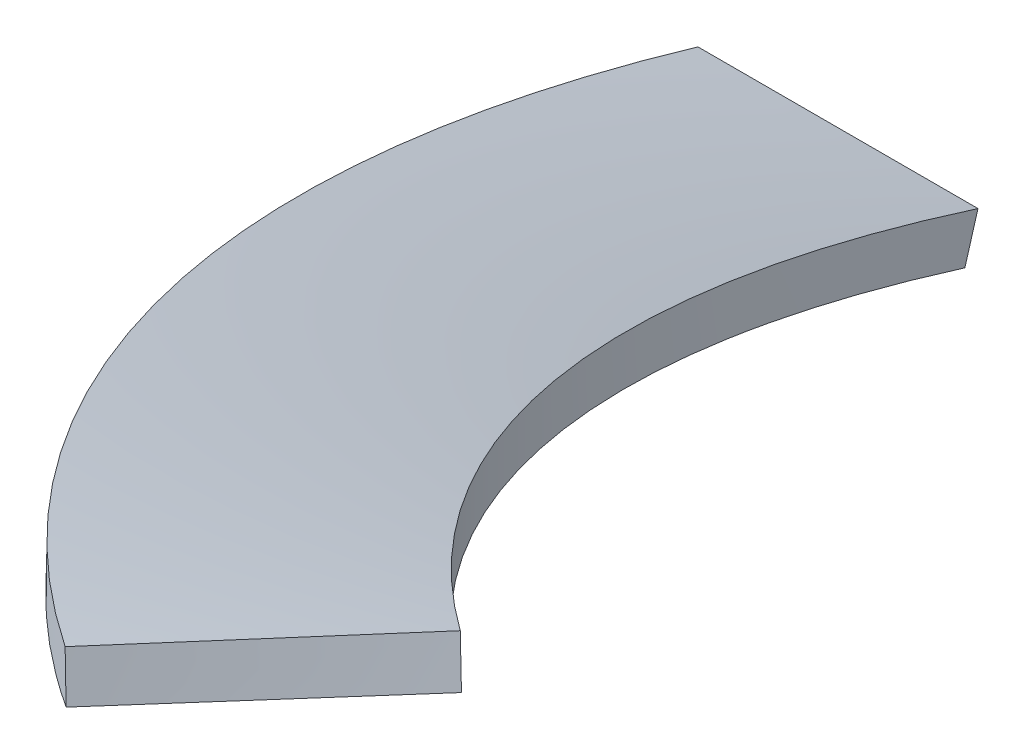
ISO-10303-21;
HEADER;
FILE_DESCRIPTION(('STEP AP214'),'2;1');
FILE_NAME('part.step','',(''),(''),'','','');
FILE_SCHEMA(('AUTOMOTIVE_DESIGN { 1 0 10303 214 1 1 1 1 }'));
ENDSEC;
DATA;
#1=APPLICATION_CONTEXT('core data for automotive mechanical design processes');
#2=APPLICATION_PROTOCOL_DEFINITION('international standard','automotive_design',2000,#1);
#3=PRODUCT_CONTEXT('',#1,'mechanical');
#4=PRODUCT('Part','Part','',(#3));
#5=PRODUCT_RELATED_PRODUCT_CATEGORY('part','',(#4));
#6=PRODUCT_DEFINITION_FORMATION('','',#4);
#7=PRODUCT_DEFINITION_CONTEXT('part definition',#1,'design');
#8=PRODUCT_DEFINITION('design','',#6,#7);
#9=PRODUCT_DEFINITION_SHAPE('','',#8);
#10=(LENGTH_UNIT() NAMED_UNIT(*) SI_UNIT(.MILLI.,.METRE.));
#11=(NAMED_UNIT(*) PLANE_ANGLE_UNIT() SI_UNIT($,.RADIAN.));
#12=(NAMED_UNIT(*) SI_UNIT($,.STERADIAN.) SOLID_ANGLE_UNIT());
#13=UNCERTAINTY_MEASURE_WITH_UNIT(LENGTH_MEASURE(1.E-05),#10,'distance_accuracy_value','');
#14=(GEOMETRIC_REPRESENTATION_CONTEXT(3) GLOBAL_UNCERTAINTY_ASSIGNED_CONTEXT((#13)) GLOBAL_UNIT_ASSIGNED_CONTEXT((#10,
#11,#12)) REPRESENTATION_CONTEXT('',''));
#15=CARTESIAN_POINT('',(0.,0.,0.));
#16=DIRECTION('',(0.,0.,1.));
#17=DIRECTION('',(1.,0.,0.));
#18=AXIS2_PLACEMENT_3D('',#15,#16,#17);
#19=CARTESIAN_POINT('',(-175.193409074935,60.3369175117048,205.460201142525));
#20=CARTESIAN_POINT('',(-237.087912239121,39.3166045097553,156.373113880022));
#21=CARTESIAN_POINT('',(-272.113883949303,13.6346725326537,81.9466816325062));
#22=CARTESIAN_POINT('',(-270.,-9.59508945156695,2.81678157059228));
#23=CARTESIAN_POINT('',(-177.135937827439,70.,203.771586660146));
#24=CARTESIAN_POINT('',(-238.775544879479,48.8557085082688,153.681809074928));
#25=CARTESIAN_POINT('',(-272.894339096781,23.137303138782,78.8149480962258));
#26=CARTESIAN_POINT('',(-270.,0.,0.));
#27=B_SPLINE_SURFACE_WITH_KNOTS('',1,3,((#19,#20,#21,#22),(#23,#24,#25,#26)),.UNSPECIFIED.,.F.,
.F.,.F.,(2,2),(4,4),(0.,1.),(0.,1.),.UNSPECIFIED.);
#28=CARTESIAN_POINT('',(-270.,0.,0.));
#29=CARTESIAN_POINT('',(-270.,-9.59508945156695,2.81678157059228));
#30=B_SPLINE_CURVE_WITH_KNOTS('',1,(#28,#29),.UNSPECIFIED.,.F.,.F.,(2,2),(0.,1.),.UNSPECIFIED.);
#31=CARTESIAN_POINT('',(-270.,0.,0.));
#32=VERTEX_POINT('',#31);
#33=CARTESIAN_POINT('',(-270.00000003,-9.59508945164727,2.81678157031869));
#34=VERTEX_POINT('',#33);
#35=EDGE_CURVE('E14',#32,#34,#30,.T.);
#36=CARTESIAN_POINT('',(-270.,0.,0.));
#37=CARTESIAN_POINT('',(-272.894339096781,23.137303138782,78.8149480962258));
#38=CARTESIAN_POINT('',(-238.775544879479,48.8557085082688,153.681809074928));
#39=CARTESIAN_POINT('',(-177.135937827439,70.,203.771586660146));
#40=B_SPLINE_CURVE_WITH_KNOTS('',3,(#36,#37,#38,#39),.UNSPECIFIED.,.F.,.F.,(4,4),(0.,1.),.UNSPECIFIED.);
#41=CARTESIAN_POINT('',(-177.135937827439,70.,203.771586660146));
#42=VERTEX_POINT('',#41);
#43=EDGE_CURVE('E240',#32,#42,#40,.T.);
#44=CARTESIAN_POINT('',(-177.135937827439,70.,203.771586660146));
#45=CARTESIAN_POINT('',(-175.193409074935,60.3369175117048,205.460201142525));
#46=B_SPLINE_CURVE_WITH_KNOTS('',1,(#44,#45),.UNSPECIFIED.,.F.,.F.,(2,2),(0.,1.),.UNSPECIFIED.);
#47=CARTESIAN_POINT('',(-175.193409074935,60.3369175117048,205.460201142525));
#48=VERTEX_POINT('',#47);
#49=EDGE_CURVE('E73',#42,#48,#46,.T.);
#50=CARTESIAN_POINT('',(-270.,-9.59508945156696,2.81678157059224));
#51=CARTESIAN_POINT('',(-270.131868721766,-8.1483533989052,7.74501807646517));
#52=CARTESIAN_POINT('',(-270.119708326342,-6.68677843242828,12.6727601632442));
#53=CARTESIAN_POINT('',(-269.808527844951,-3.74764646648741,22.4814964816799));
#54=CARTESIAN_POINT('',(-269.511264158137,-2.27024206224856,27.3625922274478));
#55=CARTESIAN_POINT('',(-268.634944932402,0.696987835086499,37.0678336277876));
#56=CARTESIAN_POINT('',(-268.057354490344,2.18670959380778,41.8921432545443));
#57=CARTESIAN_POINT('',(-266.625741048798,5.17500170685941,51.4736454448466));
#58=CARTESIAN_POINT('',(-265.772914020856,6.67350672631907,56.2310371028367));
#59=CARTESIAN_POINT('',(-263.796074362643,9.67582153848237,65.6685740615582));
#60=CARTESIAN_POINT('',(-262.673011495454,11.1795949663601,70.3489298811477));
#61=CARTESIAN_POINT('',(-260.160945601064,14.1889177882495,79.6222954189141));
#62=CARTESIAN_POINT('',(-258.772666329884,15.6944515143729,84.2155062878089));
#63=CARTESIAN_POINT('',(-255.735386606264,18.7037823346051,93.3045081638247));
#64=CARTESIAN_POINT('',(-254.086901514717,20.2075770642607,97.800472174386));
#65=CARTESIAN_POINT('',(-250.534414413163,23.2099314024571,106.68492955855));
#66=CARTESIAN_POINT('',(-248.630734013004,24.7084952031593,111.073550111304));
#67=CARTESIAN_POINT('',(-244.573048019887,27.6969028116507,119.733291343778));
#68=CARTESIAN_POINT('',(-242.419181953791,29.1867509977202,124.004475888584));
#69=CARTESIAN_POINT('',(-237.866308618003,32.1542560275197,132.419337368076));
#70=CARTESIAN_POINT('',(-235.467267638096,33.6319111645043,136.562996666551));
#71=CARTESIAN_POINT('',(-230.429224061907,36.571572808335,144.712822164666));
#72=CARTESIAN_POINT('',(-227.79002088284,38.0335650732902,148.718869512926));
#73=CARTESIAN_POINT('',(-222.276832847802,40.9384593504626,156.583511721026));
#74=CARTESIAN_POINT('',(-219.402484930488,42.3813276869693,160.441864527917));
#75=CARTESIAN_POINT('',(-213.424185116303,45.2445489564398,168.00118236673));
#76=CARTESIAN_POINT('',(-210.319710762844,46.6648411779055,171.701757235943));
#77=CARTESIAN_POINT('',(-203.886354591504,49.4795085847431,178.935633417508));
#78=CARTESIAN_POINT('',(-200.556793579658,50.8737875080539,182.468368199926));
#79=CARTESIAN_POINT('',(-193.67840704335,53.6330370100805,189.35665583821));
#80=CARTESIAN_POINT('',(-190.128748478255,54.9978660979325,192.711433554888));
#81=CARTESIAN_POINT('',(-182.815528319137,57.6949006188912,199.23417451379));
#82=CARTESIAN_POINT('',(-179.050985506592,59.0269086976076,202.401119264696));
#83=CARTESIAN_POINT('',(-175.193409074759,60.3369175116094,205.460201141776));
#84=B_SPLINE_CURVE_WITH_KNOTS('',3,(#50,#51,#52,#53,#54,#55,#56,#57,#58,#59,#60,#61,#62,#63,#64,
#65,#66,#67,#68,#69,#70,#71,#72,#73,#74,#75,#76,#77,#78,#79,#80,#81,#82,#83),.UNSPECIFIED.,.F.,
.F.,(4,2,2,2,2,2,2,2,2,2,2,2,2,2,2,2,4),(0.,15.4116577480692,30.7289766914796,45.9670896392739,
61.1398610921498,76.260066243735,91.339584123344,106.389602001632,121.42082834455,
136.443711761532,151.468663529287,166.506281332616,181.567571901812,196.66417014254,
211.808552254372,227.014240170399,242.295994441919),.UNSPECIFIED.);
#85=EDGE_CURVE('E126',#34,#48,#84,.T.);
#86=ORIENTED_EDGE('',*,*,#35,.F.);
#87=ORIENTED_EDGE('',*,*,#43,.T.);
#88=ORIENTED_EDGE('',*,*,#49,.T.);
#89=ORIENTED_EDGE('',*,*,#85,.F.);
#90=EDGE_LOOP('',(#86,#87,#88,#89));
#91=FACE_BOUND('',#90,.T.);
#92=ADVANCED_FACE('F59',(#91),#27,.F.);
#93=CARTESIAN_POINT('',(-175.193409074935,60.3369175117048,205.460201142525));
#94=CARTESIAN_POINT('',(-188.478628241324,60.2790215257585,220.411788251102));
#95=CARTESIAN_POINT('',(-201.73144094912,60.2397884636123,235.391563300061));
#96=CARTESIAN_POINT('',(-214.965490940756,60.2087426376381,250.387637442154));
#97=CARTESIAN_POINT('',(-177.135937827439,70.,203.771586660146));
#98=CARTESIAN_POINT('',(-190.25711840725,70.,218.865778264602));
#99=CARTESIAN_POINT('',(-203.37829898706,70.,233.959969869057));
#100=CARTESIAN_POINT('',(-216.49947956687,70.,249.054161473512));
#101=B_SPLINE_SURFACE_WITH_KNOTS('',1,3,((#93,#94,#95,#96),(#97,#98,#99,#100)),.UNSPECIFIED.,
.F.,.F.,.F.,(2,2),(4,4),(0.,1.),(-0.03,0.03),.UNSPECIFIED.);
#102=CARTESIAN_POINT('',(-177.135937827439,70.,203.771586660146));
#103=CARTESIAN_POINT('',(-190.25711840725,70.,218.865778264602));
#104=CARTESIAN_POINT('',(-203.37829898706,70.,233.959969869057));
#105=CARTESIAN_POINT('',(-216.49947956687,70.,249.054161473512));
#106=B_SPLINE_CURVE_WITH_KNOTS('',3,(#102,#103,#104,#105),.UNSPECIFIED.,.F.,.F.,(4,4),(-0.03,
0.03),.UNSPECIFIED.);
#107=CARTESIAN_POINT('',(-216.49947956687,70.,249.054161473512));
#108=VERTEX_POINT('',#107);
#109=EDGE_CURVE('E109',#42,#108,#106,.T.);
#110=CARTESIAN_POINT('',(-216.49947956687,70.,249.054161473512));
#111=CARTESIAN_POINT('',(-214.965490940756,60.2087426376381,250.387637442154));
#112=B_SPLINE_CURVE_WITH_KNOTS('',1,(#110,#111),.UNSPECIFIED.,.F.,.F.,(2,2),(0.,1.),.UNSPECIFIED.);
#113=CARTESIAN_POINT('',(-214.965490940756,60.2087426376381,250.387637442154));
#114=VERTEX_POINT('',#113);
#115=EDGE_CURVE('E103',#108,#114,#112,.T.);
#116=CARTESIAN_POINT('',(-175.193409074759,60.3369175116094,205.460201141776));
#117=CARTESIAN_POINT('',(-176.854055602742,60.3296818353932,207.329145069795));
#118=CARTESIAN_POINT('',(-178.514190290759,60.3227495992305,209.198544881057));
#119=CARTESIAN_POINT('',(-181.833491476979,60.309436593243,212.938186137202));
#120=CARTESIAN_POINT('',(-183.492657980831,60.3030558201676,214.808427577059));
#121=CARTESIAN_POINT('',(-186.810089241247,60.2907902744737,218.549694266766));
#122=CARTESIAN_POINT('',(-188.468354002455,60.2849054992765,220.42071951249));
#123=CARTESIAN_POINT('',(-191.784041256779,60.2735846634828,224.163502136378));
#124=CARTESIAN_POINT('',(-193.441463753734,60.2681486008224,226.035259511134));
#125=CARTESIAN_POINT('',(-196.755521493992,60.2576827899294,229.779458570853));
#126=CARTESIAN_POINT('',(-198.412156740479,60.2526530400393,231.651900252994));
#127=CARTESIAN_POINT('',(-201.724690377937,60.2429623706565,235.39742412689));
#128=CARTESIAN_POINT('',(-203.380588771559,60.238301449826,237.270506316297));
#129=CARTESIAN_POINT('',(-206.691695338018,60.2293148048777,241.017270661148));
#130=CARTESIAN_POINT('',(-208.346903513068,60.2249890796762,242.890952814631));
#131=CARTESIAN_POINT('',(-211.656671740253,60.2166436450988,246.638880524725));
#132=CARTESIAN_POINT('',(-213.311231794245,60.2126239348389,248.513126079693));
#133=CARTESIAN_POINT('',(-214.96549093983,60.2087426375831,250.387637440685));
#134=B_SPLINE_CURVE_WITH_KNOTS('',3,(#116,#117,#118,#119,#120,#121,#122,#123,#124,#125,#126,
#127,#128,#129,#130,#131,#132,#133),.UNSPECIFIED.,.F.,.F.,(4,2,2,2,2,2,2,2,4),(0.,
7.50045017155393,15.0008561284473,22.5012230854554,30.0015555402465,37.5018573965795,
45.0021320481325,52.5023824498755,60.0026111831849),.UNSPECIFIED.);
#135=EDGE_CURVE('E107',#48,#114,#134,.T.);
#136=ORIENTED_EDGE('',*,*,#49,.F.);
#137=ORIENTED_EDGE('',*,*,#109,.T.);
#138=ORIENTED_EDGE('',*,*,#115,.T.);
#139=ORIENTED_EDGE('',*,*,#135,.F.);
#140=EDGE_LOOP('',(#136,#137,#138,#139));
#141=FACE_BOUND('',#140,.T.);
#142=ADVANCED_FACE('F106',(#141),#101,.T.);
#143=CARTESIAN_POINT('',(-214.965490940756,60.2087426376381,250.387637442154));
#144=CARTESIAN_POINT('',(-293.117488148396,40.0469066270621,192.249768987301));
#145=CARTESIAN_POINT('',(-336.339228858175,13.8986842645,99.4837045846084));
#146=CARTESIAN_POINT('',(-330.,-9.71687059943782,2.36271575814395));
#147=CARTESIAN_POINT('',(-216.49947956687,70.,249.054161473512));
#148=CARTESIAN_POINT('',(-294.518646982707,49.7372758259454,190.022702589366));
#149=CARTESIAN_POINT('',(-336.982063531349,23.5485046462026,96.8452390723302));
#150=CARTESIAN_POINT('',(-330.,0.,0.));
#151=B_SPLINE_SURFACE_WITH_KNOTS('',1,3,((#143,#144,#145,#146),(#147,#148,#149,#150)),
.UNSPECIFIED.,.F.,.F.,.F.,(2,2),(4,4),(0.,1.),(0.,1.),.UNSPECIFIED.);
#152=CARTESIAN_POINT('',(-216.49947956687,70.,249.054161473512));
#153=CARTESIAN_POINT('',(-294.518646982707,49.7372758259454,190.022702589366));
#154=CARTESIAN_POINT('',(-336.982063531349,23.5485046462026,96.8452390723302));
#155=CARTESIAN_POINT('',(-330.,0.,0.));
#156=B_SPLINE_CURVE_WITH_KNOTS('',3,(#152,#153,#154,#155),.UNSPECIFIED.,.F.,.F.,(4,4),(0.,1.),.UNSPECIFIED.);
#157=CARTESIAN_POINT('',(-330.,0.,0.));
#158=VERTEX_POINT('',#157);
#159=EDGE_CURVE('E128',#108,#158,#156,.T.);
#160=CARTESIAN_POINT('',(-330.,0.,0.));
#161=CARTESIAN_POINT('',(-330.,-9.71687059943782,2.36271575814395));
#162=B_SPLINE_CURVE_WITH_KNOTS('',1,(#160,#161),.UNSPECIFIED.,.F.,.F.,(2,2),(0.,1.),.UNSPECIFIED.);
#163=CARTESIAN_POINT('',(-329.99999997,-9.71687059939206,2.36271575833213));
#164=VERTEX_POINT('',#163);
#165=EDGE_CURVE('E116',#158,#164,#162,.T.);
#166=CARTESIAN_POINT('',(-214.96549093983,60.2087426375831,250.387637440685));
#167=CARTESIAN_POINT('',(-217.403238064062,59.5798541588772,248.574207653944));
#168=CARTESIAN_POINT('',(-219.811568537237,58.9439743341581,246.723655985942));
#169=CARTESIAN_POINT('',(-224.558935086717,57.6610302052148,242.956536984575));
#170=CARTESIAN_POINT('',(-226.898180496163,57.0140117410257,241.040217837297));
#171=CARTESIAN_POINT('',(-231.506474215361,55.7093032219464,237.143411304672));
#172=CARTESIAN_POINT('',(-233.775718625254,55.0516527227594,235.163142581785));
#173=CARTESIAN_POINT('',(-238.243129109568,53.7261991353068,231.140311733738));
#174=CARTESIAN_POINT('',(-240.441477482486,53.0584298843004,229.097940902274));
#175=CARTESIAN_POINT('',(-244.766210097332,51.7132568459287,224.952772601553));
#176=CARTESIAN_POINT('',(-246.892762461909,51.0358817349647,222.850141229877));
#177=CARTESIAN_POINT('',(-251.073019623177,49.6720158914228,218.586319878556));
#178=CARTESIAN_POINT('',(-253.12687806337,48.9855491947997,216.425272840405));
#179=CARTESIAN_POINT('',(-257.160864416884,47.6040194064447,212.046486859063));
#180=CARTESIAN_POINT('',(-259.141131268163,46.9089762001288,209.82886963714));
#181=CARTESIAN_POINT('',(-263.027052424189,45.510813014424,205.338809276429));
#182=CARTESIAN_POINT('',(-264.932830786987,44.8077092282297,203.066468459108));
#183=CARTESIAN_POINT('',(-268.668893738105,43.3939448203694,198.468825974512));
#184=CARTESIAN_POINT('',(-270.499287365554,42.68329712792,196.143608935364));
#185=CARTESIAN_POINT('',(-274.083700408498,41.2549651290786,191.442078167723));
#186=CARTESIAN_POINT('',(-275.837813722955,40.5372908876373,189.065832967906));
#187=CARTESIAN_POINT('',(-279.26878647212,39.0954262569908,184.264109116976));
#188=CARTESIAN_POINT('',(-280.945724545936,38.3712434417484,181.83868438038));
#189=CARTESIAN_POINT('',(-284.221467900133,36.9168823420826,176.940463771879));
#190=CARTESIAN_POINT('',(-285.820336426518,36.1867094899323,174.467708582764));
#191=CARTESIAN_POINT('',(-288.939062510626,34.7208891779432,169.476688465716));
#192=CARTESIAN_POINT('',(-290.458967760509,33.9852453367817,166.958452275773));
#193=CARTESIAN_POINT('',(-293.418889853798,32.5090040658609,161.878330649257));
#194=CARTESIAN_POINT('',(-294.858938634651,31.7684087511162,159.316463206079));
#195=CARTESIAN_POINT('',(-297.658271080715,30.2827856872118,154.150938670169));
#196=CARTESIAN_POINT('',(-299.01757067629,29.5377588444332,151.547289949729));
#197=CARTESIAN_POINT('',(-301.654528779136,28.0437939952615,146.300061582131));
#198=CARTESIAN_POINT('',(-302.932186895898,27.294855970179,143.656481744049));
#199=CARTESIAN_POINT('',(-305.404986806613,25.7935901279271,138.33124900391));
#200=CARTESIAN_POINT('',(-306.600111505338,25.0412616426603,135.649588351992));
#201=CARTESIAN_POINT('',(-308.906970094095,23.5337363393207,130.250051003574));
#202=CARTESIAN_POINT('',(-310.018669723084,22.7785384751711,127.532159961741));
#203=CARTESIAN_POINT('',(-312.157804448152,21.2657959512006,122.062018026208));
#204=CARTESIAN_POINT('',(-313.185187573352,20.5082501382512,119.309747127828));
#205=CARTESIAN_POINT('',(-315.154816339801,18.9913333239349,113.772700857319));
#206=CARTESIAN_POINT('',(-316.096991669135,18.2319613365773,110.987900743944));
#207=CARTESIAN_POINT('',(-317.895332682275,16.7119138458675,105.38765062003));
#208=CARTESIAN_POINT('',(-318.751408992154,15.9512378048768,102.572172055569));
#209=CARTESIAN_POINT('',(-320.376680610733,14.4291039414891,96.9124188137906));
#210=CARTESIAN_POINT('',(-321.145766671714,13.667646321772,94.0681127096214));
#211=CARTESIAN_POINT('',(-322.596187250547,12.1444710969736,88.3525573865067));
#212=CARTESIAN_POINT('',(-323.277391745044,11.3827547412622,85.4812748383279));
#213=CARTESIAN_POINT('',(-324.551179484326,9.85958390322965,79.713618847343));
#214=CARTESIAN_POINT('',(-325.143610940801,9.0981320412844,76.8172111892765));
#215=CARTESIAN_POINT('',(-326.238983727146,7.5760121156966,71.0011564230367));
#216=CARTESIAN_POINT('',(-326.741750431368,6.8153483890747,68.0814752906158));
#217=CARTESIAN_POINT('',(-327.656925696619,5.29532672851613,62.2207242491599));
#218=CARTESIAN_POINT('',(-328.069135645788,4.53597521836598,59.2796216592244));
#219=CARTESIAN_POINT('',(-328.802330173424,3.01910006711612,53.3778776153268));
#220=CARTESIAN_POINT('',(-329.123090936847,2.26158533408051,50.4172060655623));
#221=CARTESIAN_POINT('',(-329.672520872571,0.748905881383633,44.478173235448));
#222=CARTESIAN_POINT('',(-329.900939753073,-0.00624701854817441,41.4997857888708));
#223=CARTESIAN_POINT('',(-330.264819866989,-1.51368050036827,35.5271696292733));
#224=CARTESIAN_POINT('',(-330.400003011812,-2.2659458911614,32.5329201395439));
#225=CARTESIAN_POINT('',(-330.576548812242,-3.76708218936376,26.5304273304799));
#226=CARTESIAN_POINT('',(-330.617604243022,-4.5159340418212,23.5221702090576));
#227=CARTESIAN_POINT('',(-330.605023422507,-6.00972006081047,17.4935099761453));
#228=CARTESIAN_POINT('',(-330.551049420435,-6.75463077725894,14.4731017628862));
#229=CARTESIAN_POINT('',(-330.347573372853,-8.24001463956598,8.42198235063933));
#230=CARTESIAN_POINT('',(-330.197701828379,-8.98045938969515,5.39127659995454));
#231=CARTESIAN_POINT('',(-330.,-9.71687059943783,2.36271575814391));
#232=B_SPLINE_CURVE_WITH_KNOTS('',3,(#166,#167,#168,#169,#170,#171,#172,#173,#174,#175,#176,
#177,#178,#179,#180,#181,#182,#183,#184,#185,#186,#187,#188,#189,#190,#191,#192,#193,#194,#195,
#196,#197,#198,#199,#200,#201,#202,#203,#204,#205,#206,#207,#208,#209,#210,#211,#212,#213,#214,
#215,#216,#217,#218,#219,#220,#221,#222,#223,#224,#225,#226,#227,#228,#229,#230,#231),
.UNSPECIFIED.,.F.,.F.,(4,2,2,2,2,2,2,2,2,2,2,2,2,2,2,2,2,2,2,2,2,2,2,2,2,2,2,2,2,2,2,2,4),(0.,
9.30768054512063,18.5834380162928,27.8302790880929,37.0510593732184,46.2484921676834,
55.4251577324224,64.5835130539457,73.7259020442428,82.854566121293,91.9716551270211,
101.079238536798,110.179316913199,119.273833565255,128.36468636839,137.453739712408,
146.542836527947,155.63381036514,164.728497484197,173.828748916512,182.936442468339,
192.053494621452,201.181872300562,210.323604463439,219.480793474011,228.655626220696,
237.850384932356,247.067457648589,256.309348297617,265.578686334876,274.878235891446,
284.210904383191,293.579750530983),.UNSPECIFIED.);
#233=EDGE_CURVE('E124',#114,#164,#232,.T.);
#234=ORIENTED_EDGE('',*,*,#115,.F.);
#235=ORIENTED_EDGE('',*,*,#159,.T.);
#236=ORIENTED_EDGE('',*,*,#165,.T.);
#237=ORIENTED_EDGE('',*,*,#233,.F.);
#238=EDGE_LOOP('',(#234,#235,#236,#237));
#239=FACE_BOUND('',#238,.T.);
#240=ADVANCED_FACE('F133',(#239),#151,.T.);
#241=CARTESIAN_POINT('',(-330.,-9.71687059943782,2.36271575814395));
#242=CARTESIAN_POINT('',(-310.000000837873,-9.68636494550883,2.48817286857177));
#243=CARTESIAN_POINT('',(-289.999995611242,-9.64863292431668,2.63439099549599));
#244=CARTESIAN_POINT('',(-270.,-9.59508945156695,2.81678157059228));
#245=CARTESIAN_POINT('',(-330.,0.,0.));
#246=CARTESIAN_POINT('',(-309.999999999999,0.,0.));
#247=CARTESIAN_POINT('',(-290.,0.,0.));
#248=CARTESIAN_POINT('',(-270.,0.,0.));
#249=B_SPLINE_SURFACE_WITH_KNOTS('',1,3,((#241,#242,#243,#244),(#245,#246,#247,#248)),
.UNSPECIFIED.,.F.,.F.,.F.,(2,2),(4,4),(0.,1.),(-0.03,0.03),.UNSPECIFIED.);
#250=CARTESIAN_POINT('',(-330.,0.,0.));
#251=CARTESIAN_POINT('',(-309.999999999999,0.,0.));
#252=CARTESIAN_POINT('',(-290.,0.,0.));
#253=CARTESIAN_POINT('',(-270.,0.,0.));
#254=B_SPLINE_CURVE_WITH_KNOTS('',3,(#250,#251,#252,#253),.UNSPECIFIED.,.F.,.F.,(4,4),(-0.03,
0.03),.UNSPECIFIED.);
#255=EDGE_CURVE('E234',#158,#32,#254,.T.);
#256=CARTESIAN_POINT('',(-330.,-9.71687059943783,2.36271575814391));
#257=CARTESIAN_POINT('',(-327.49999762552,-9.71305693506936,2.37839859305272));
#258=CARTESIAN_POINT('',(-324.999997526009,-9.70912193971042,2.39441735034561));
#259=CARTESIAN_POINT('',(-319.999997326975,-9.70098517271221,2.42717386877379));
#260=CARTESIAN_POINT('',(-317.499997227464,-9.69678340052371,2.4439116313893));
#261=CARTESIAN_POINT('',(-312.499997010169,-9.68808897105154,2.4781532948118));
#262=CARTESIAN_POINT('',(-309.9999968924,-9.68359631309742,2.49565719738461));
#263=CARTESIAN_POINT('',(-304.999996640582,-9.67429242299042,2.53148350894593));
#264=CARTESIAN_POINT('',(-302.499996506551,-9.66948119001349,2.54980592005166));
#265=CARTESIAN_POINT('',(-297.4999962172,-9.65950936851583,2.58732596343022));
#266=CARTESIAN_POINT('',(-294.999996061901,-9.65434877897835,2.60652359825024));
#267=CARTESIAN_POINT('',(-289.999995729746,-9.64364351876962,2.6458561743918));
#268=CARTESIAN_POINT('',(-287.499995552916,-9.63809884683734,2.66599111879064));
#269=CARTESIAN_POINT('',(-282.499995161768,-9.62658677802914,2.70726560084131));
#270=CARTESIAN_POINT('',(-279.999994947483,-9.62061937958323,2.72840514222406));
#271=CARTESIAN_POINT('',(-274.999994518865,-9.60821665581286,2.77176437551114));
#272=CARTESIAN_POINT('',(-272.499994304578,-9.60178132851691,2.79398407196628));
#273=CARTESIAN_POINT('',(-270.,-9.59508945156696,2.81678157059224));
#274=B_SPLINE_CURVE_WITH_KNOTS('',3,(#256,#257,#258,#259,#260,#261,#262,#263,#264,#265,#266,
#267,#268,#269,#270,#271,#272,#273),.UNSPECIFIED.,.F.,.F.,(4,2,2,2,2,2,2,2,4),(0.,
7.50016341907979,15.0003422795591,22.5005384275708,30.0007539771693,37.5009913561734,
45.0012533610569,52.5015432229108,60.0018646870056),.UNSPECIFIED.);
#275=EDGE_CURVE('E136',#164,#34,#274,.T.);
#276=ORIENTED_EDGE('',*,*,#255,.T.);
#277=ORIENTED_EDGE('',*,*,#35,.T.);
#278=ORIENTED_EDGE('',*,*,#275,.F.);
#279=ORIENTED_EDGE('',*,*,#165,.F.);
#280=EDGE_LOOP('',(#276,#277,#278,#279));
#281=FACE_BOUND('',#280,.T.);
#282=ADVANCED_FACE('F61',(#281),#249,.T.);
#283=CARTESIAN_POINT('',(-216.49947956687,70.,249.054161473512));
#284=CARTESIAN_POINT('',(-177.135937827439,70.,203.771586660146));
#285=CARTESIAN_POINT('',(-294.518646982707,49.7372758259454,190.022702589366));
#286=CARTESIAN_POINT('',(-238.775544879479,48.8557085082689,153.681809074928));
#287=CARTESIAN_POINT('',(-336.982063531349,23.5485046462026,96.8452390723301));
#288=CARTESIAN_POINT('',(-272.894339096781,23.137303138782,78.8149480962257));
#289=CARTESIAN_POINT('',(-330.,0.,0.));
#290=CARTESIAN_POINT('',(-270.,0.,0.));
#291=B_SPLINE_SURFACE_WITH_KNOTS('',3,1,((#283,#284),(#285,#286),(#287,#288),(#289,#290)),
.UNSPECIFIED.,.F.,.F.,.F.,(4,4),(2,2),(0.,1.),(0.,1.),.UNSPECIFIED.);
#292=OFFSET_SURFACE('',#291,10.,.F.);
#293=ORIENTED_EDGE('',*,*,#233,.T.);
#294=ORIENTED_EDGE('',*,*,#275,.T.);
#295=ORIENTED_EDGE('',*,*,#85,.T.);
#296=ORIENTED_EDGE('',*,*,#135,.T.);
#297=EDGE_LOOP('',(#293,#294,#295,#296));
#298=FACE_BOUND('',#297,.T.);
#299=ADVANCED_FACE('F122',(#298),#292,.T.);
#300=CARTESIAN_POINT('',(-216.49947956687,70.,249.054161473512));
#301=CARTESIAN_POINT('',(-177.135937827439,70.,203.771586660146));
#302=CARTESIAN_POINT('',(-294.518646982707,49.7372758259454,190.022702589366));
#303=CARTESIAN_POINT('',(-238.775544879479,48.8557085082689,153.681809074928));
#304=CARTESIAN_POINT('',(-336.982063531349,23.5485046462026,96.8452390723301));
#305=CARTESIAN_POINT('',(-272.894339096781,23.137303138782,78.8149480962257));
#306=CARTESIAN_POINT('',(-330.,0.,0.));
#307=CARTESIAN_POINT('',(-270.,0.,0.));
#308=B_SPLINE_SURFACE_WITH_KNOTS('',3,1,((#300,#301),(#302,#303),(#304,#305),(#306,#307)),
.UNSPECIFIED.,.F.,.F.,.F.,(4,4),(2,2),(0.,1.),(0.,1.),.UNSPECIFIED.);
#309=ORIENTED_EDGE('',*,*,#159,.F.);
#310=ORIENTED_EDGE('',*,*,#109,.F.);
#311=ORIENTED_EDGE('',*,*,#43,.F.);
#312=ORIENTED_EDGE('',*,*,#255,.F.);
#313=EDGE_LOOP('',(#309,#310,#311,#312));
#314=FACE_BOUND('',#313,.T.);
#315=ADVANCED_FACE('F230',(#314),#308,.F.);
#316=CLOSED_SHELL('',(#92,#142,#240,#282,#299,#315));
#317=MANIFOLD_SOLID_BREP('B2',#316);
#318=ADVANCED_BREP_SHAPE_REPRESENTATION('',(#18,#317),#14);
#319=SHAPE_DEFINITION_REPRESENTATION(#9,#318);
ENDSEC;
END-ISO-10303-21;
